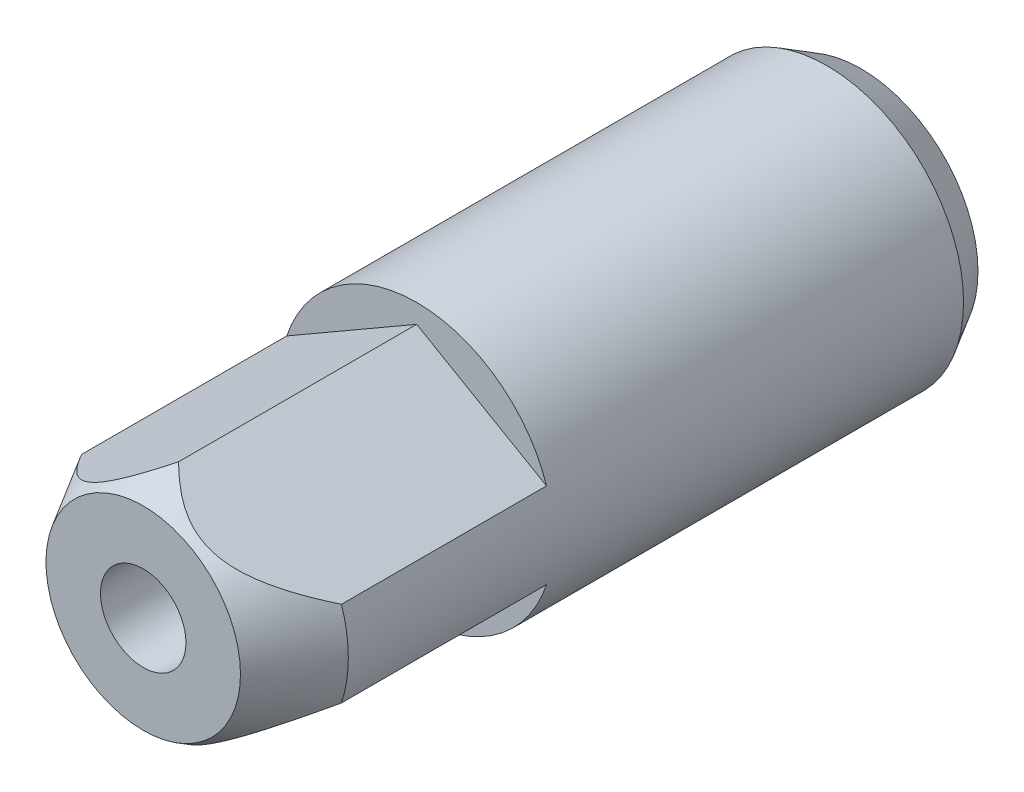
ISO-10303-21;
HEADER;
FILE_DESCRIPTION(('STEP AP214'),'2;1');
FILE_NAME('part.step','',(''),(''),'','','');
FILE_SCHEMA(('AUTOMOTIVE_DESIGN { 1 0 10303 214 1 1 1 1 }'));
ENDSEC;
DATA;
#1=APPLICATION_CONTEXT('core data for automotive mechanical design processes');
#2=APPLICATION_PROTOCOL_DEFINITION('international standard','automotive_design',2000,#1);
#3=PRODUCT_CONTEXT('',#1,'mechanical');
#4=PRODUCT('Part','Part','',(#3));
#5=PRODUCT_RELATED_PRODUCT_CATEGORY('part','',(#4));
#6=PRODUCT_DEFINITION_FORMATION('','',#4);
#7=PRODUCT_DEFINITION_CONTEXT('part definition',#1,'design');
#8=PRODUCT_DEFINITION('design','',#6,#7);
#9=PRODUCT_DEFINITION_SHAPE('','',#8);
#10=(LENGTH_UNIT() NAMED_UNIT(*) SI_UNIT(.MILLI.,.METRE.));
#11=(NAMED_UNIT(*) PLANE_ANGLE_UNIT() SI_UNIT($,.RADIAN.));
#12=(NAMED_UNIT(*) SI_UNIT($,.STERADIAN.) SOLID_ANGLE_UNIT());
#13=UNCERTAINTY_MEASURE_WITH_UNIT(LENGTH_MEASURE(1.E-05),#10,'distance_accuracy_value','');
#14=(GEOMETRIC_REPRESENTATION_CONTEXT(3) GLOBAL_UNCERTAINTY_ASSIGNED_CONTEXT((#13)) GLOBAL_UNIT_ASSIGNED_CONTEXT((#10,
#11,#12)) REPRESENTATION_CONTEXT('',''));
#15=CARTESIAN_POINT('',(0.,0.,0.));
#16=DIRECTION('',(0.,0.,1.));
#17=DIRECTION('',(1.,0.,0.));
#18=AXIS2_PLACEMENT_3D('',#15,#16,#17);
#19=CARTESIAN_POINT('',(0.,0.,38.));
#20=DIRECTION('',(0.,0.,-1.));
#21=DIRECTION('',(-1.,0.,0.));
#22=AXIS2_PLACEMENT_3D('',#19,#20,#21);
#23=CONICAL_SURFACE('',#22,8.,0.523598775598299);
#24=CARTESIAN_POINT('',(0.,0.,42.));
#25=DIRECTION('',(0.,0.,1.));
#26=DIRECTION('',(1.,0.,0.));
#27=AXIS2_PLACEMENT_3D('',#24,#25,#26);
#28=CIRCLE('',#27,5.69059892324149);
#29=CARTESIAN_POINT('',(5.69059892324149,0.,42.));
#30=VERTEX_POINT('',#29);
#31=EDGE_CURVE('E23',#30,#30,#28,.T.);
#32=ORIENTED_EDGE('',*,*,#31,.F.);
#33=EDGE_LOOP('',(#32));
#34=FACE_BOUND('',#33,.T.);
#35=CARTESIAN_POINT('',(-0.000200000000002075,6.88759766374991,39.926737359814));
#36=CARTESIAN_POINT('',(0.0621758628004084,6.85158494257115,39.9891099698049));
#37=CARTESIAN_POINT('',(0.125174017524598,6.81521294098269,40.0506508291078));
#38=CARTESIAN_POINT('',(0.25255184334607,6.74167131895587,40.171837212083));
#39=CARTESIAN_POINT('',(0.316931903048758,6.70450147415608,40.2314821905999));
#40=CARTESIAN_POINT('',(0.512959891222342,6.59132466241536,40.4077690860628));
#41=CARTESIAN_POINT('',(0.646862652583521,6.51401586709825,40.5211223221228));
#42=CARTESIAN_POINT('',(0.925137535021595,6.35335378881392,40.739049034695));
#43=CARTESIAN_POINT('',(1.06969195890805,6.26989525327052,40.8433150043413));
#44=CARTESIAN_POINT('',(1.3666329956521,6.0984562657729,41.0352268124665));
#45=CARTESIAN_POINT('',(1.51900131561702,6.01048637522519,41.1229094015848));
#46=CARTESIAN_POINT('',(1.76048177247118,5.8710675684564,41.2413705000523));
#47=CARTESIAN_POINT('',(1.84676611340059,5.82125128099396,41.2798680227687));
#48=CARTESIAN_POINT('',(2.02159456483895,5.72031402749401,41.3494007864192));
#49=CARTESIAN_POINT('',(2.11013884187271,5.66919296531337,41.3804354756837));
#50=CARTESIAN_POINT('',(2.28843143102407,5.56625569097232,41.4338564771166));
#51=CARTESIAN_POINT('',(2.37816468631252,5.51444817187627,41.4563092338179));
#52=CARTESIAN_POINT('',(2.55898090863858,5.41005387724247,41.4921001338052));
#53=CARTESIAN_POINT('',(2.65006360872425,5.35746725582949,41.5054400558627));
#54=CARTESIAN_POINT('',(2.83378402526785,5.25139622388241,41.5225546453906));
#55=CARTESIAN_POINT('',(2.92642828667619,5.19790803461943,41.5262368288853));
#56=CARTESIAN_POINT('',(3.11160774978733,5.09099462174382,41.5236094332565));
#57=CARTESIAN_POINT('',(3.20414295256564,5.03756939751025,41.5172999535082));
#58=CARTESIAN_POINT('',(3.38848330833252,4.93114044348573,41.49494073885));
#59=CARTESIAN_POINT('',(3.48028687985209,4.87813762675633,41.4788737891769));
#60=CARTESIAN_POINT('',(3.66233939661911,4.77302955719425,41.4376314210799));
#61=CARTESIAN_POINT('',(3.75258810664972,4.72092444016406,41.4124546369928));
#62=CARTESIAN_POINT('',(3.9565949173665,4.60314105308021,41.3454884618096));
#63=CARTESIAN_POINT('',(4.069689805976,4.53784568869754,41.3010068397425));
#64=CARTESIAN_POINT('',(4.29199124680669,4.4094998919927,41.2005329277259));
#65=CARTESIAN_POINT('',(4.40119535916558,4.34645086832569,41.144533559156));
#66=CARTESIAN_POINT('',(4.61649068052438,4.22215005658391,41.0225432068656));
#67=CARTESIAN_POINT('',(4.72254600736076,4.16091898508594,40.9564685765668));
#68=CARTESIAN_POINT('',(4.93065408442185,4.04076773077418,40.8165218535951));
#69=CARTESIAN_POINT('',(5.03270776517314,3.98184701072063,40.7426515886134));
#70=CARTESIAN_POINT('',(5.25319487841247,3.85454871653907,40.5731684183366));
#71=CARTESIAN_POINT('',(5.37082122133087,3.78663711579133,40.4761620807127));
#72=CARTESIAN_POINT('',(5.60141970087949,3.65350102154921,40.2750050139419));
#73=CARTESIAN_POINT('',(5.7143902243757,3.58827745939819,40.1708518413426));
#74=CARTESIAN_POINT('',(5.93650770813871,3.46003787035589,39.9566581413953));
#75=CARTESIAN_POINT('',(6.04564475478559,3.39702756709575,39.8466039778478));
#76=CARTESIAN_POINT('',(6.26036261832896,3.27306015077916,39.6219588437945));
#77=CARTESIAN_POINT('',(6.36594307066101,3.21210324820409,39.5073674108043));
#78=CARTESIAN_POINT('',(6.56914732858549,3.09478321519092,39.2799550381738));
#79=CARTESIAN_POINT('',(6.66691236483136,3.03833854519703,39.1673017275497));
#80=CARTESIAN_POINT('',(6.85998967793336,2.92686530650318,38.9392188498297));
#81=CARTESIAN_POINT('',(6.95530179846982,2.87183682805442,38.8237891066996));
#82=CARTESIAN_POINT('',(7.14317988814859,2.76336536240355,38.591342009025));
#83=CARTESIAN_POINT('',(7.23575931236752,2.70991460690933,38.4743391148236));
#84=CARTESIAN_POINT('',(7.41901297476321,2.6041130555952,38.2384048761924));
#85=CARTESIAN_POINT('',(7.50968762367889,2.55176202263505,38.1194739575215));
#86=CARTESIAN_POINT('',(7.59954207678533,2.49988452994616,37.999733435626));
#87=B_SPLINE_CURVE_WITH_KNOTS('',3,(#35,#36,#37,#38,#39,#40,#41,#42,#43,#44,#45,#46,#47,#48,#49,
#50,#51,#52,#53,#54,#55,#56,#57,#58,#59,#60,#61,#62,#63,#64,#65,#66,#67,#68,#69,#70,#71,#72,#73,
#74,#75,#76,#77,#78,#79,#80,#81,#82,#83,#84,#85,#86),.UNSPECIFIED.,.F.,.F.,(4,2,2,2,2,2,2,2,2,2,
2,2,2,2,2,2,2,2,2,2,2,2,2,2,2,4),(0.,0.285822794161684,0.571727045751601,1.14644748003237,
1.73621258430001,2.32465498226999,2.64484729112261,2.96506326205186,3.28274720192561,
3.60036911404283,3.92102170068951,4.24167109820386,4.56288785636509,4.88415278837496,
5.29735561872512,5.71081315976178,6.12791174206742,6.54491275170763,7.04532919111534,
7.54591758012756,8.0477172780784,8.54956825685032,9.02796034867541,9.50638285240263,
9.98181067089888,10.4571348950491),.UNSPECIFIED.);
#88=CARTESIAN_POINT('',(0.,6.88748219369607,39.9269373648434));
#89=VERTEX_POINT('',#88);
#90=CARTESIAN_POINT('',(7.59934207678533,2.5,38.));
#91=VERTEX_POINT('',#90);
#92=EDGE_CURVE('E102',#89,#91,#87,.T.);
#93=ORIENTED_EDGE('',*,*,#92,.F.);
#94=CARTESIAN_POINT('',(0.000200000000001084,6.88759766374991,39.926737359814));
#95=CARTESIAN_POINT('',(-0.0621758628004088,6.85158494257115,39.9891099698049));
#96=CARTESIAN_POINT('',(-0.125174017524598,6.81521294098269,40.0506508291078));
#97=CARTESIAN_POINT('',(-0.252551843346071,6.74167131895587,40.171837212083));
#98=CARTESIAN_POINT('',(-0.31693190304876,6.70450147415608,40.2314821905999));
#99=CARTESIAN_POINT('',(-0.512959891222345,6.59132466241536,40.4077690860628));
#100=CARTESIAN_POINT('',(-0.646862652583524,6.51401586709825,40.5211223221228));
#101=CARTESIAN_POINT('',(-0.925137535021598,6.35335378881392,40.739049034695));
#102=CARTESIAN_POINT('',(-1.06969195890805,6.26989525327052,40.8433150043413));
#103=CARTESIAN_POINT('',(-1.3666329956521,6.0984562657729,41.0352268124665));
#104=CARTESIAN_POINT('',(-1.51900131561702,6.01048637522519,41.1229094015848));
#105=CARTESIAN_POINT('',(-1.76048177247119,5.8710675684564,41.2413705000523));
#106=CARTESIAN_POINT('',(-1.84676611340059,5.82125128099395,41.2798680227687));
#107=CARTESIAN_POINT('',(-2.02159456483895,5.72031402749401,41.3494007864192));
#108=CARTESIAN_POINT('',(-2.11013884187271,5.66919296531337,41.3804354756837));
#109=CARTESIAN_POINT('',(-2.28843143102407,5.56625569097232,41.4338564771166));
#110=CARTESIAN_POINT('',(-2.37816468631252,5.51444817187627,41.4563092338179));
#111=CARTESIAN_POINT('',(-2.55898090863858,5.41005387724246,41.4921001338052));
#112=CARTESIAN_POINT('',(-2.65006360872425,5.35746725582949,41.5054400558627));
#113=CARTESIAN_POINT('',(-2.83378402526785,5.25139622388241,41.5225546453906));
#114=CARTESIAN_POINT('',(-2.92642828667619,5.19790803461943,41.5262368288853));
#115=CARTESIAN_POINT('',(-3.11160774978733,5.09099462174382,41.5236094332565));
#116=CARTESIAN_POINT('',(-3.20414295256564,5.03756939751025,41.5172999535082));
#117=CARTESIAN_POINT('',(-3.38848330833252,4.93114044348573,41.49494073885));
#118=CARTESIAN_POINT('',(-3.48028687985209,4.87813762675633,41.4788737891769));
#119=CARTESIAN_POINT('',(-3.66233939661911,4.77302955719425,41.4376314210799));
#120=CARTESIAN_POINT('',(-3.75258810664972,4.72092444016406,41.4124546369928));
#121=CARTESIAN_POINT('',(-3.9565949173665,4.60314105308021,41.3454884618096));
#122=CARTESIAN_POINT('',(-4.069689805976,4.53784568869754,41.3010068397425));
#123=CARTESIAN_POINT('',(-4.29199124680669,4.4094998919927,41.2005329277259));
#124=CARTESIAN_POINT('',(-4.40119535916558,4.34645086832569,41.144533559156));
#125=CARTESIAN_POINT('',(-4.61649068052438,4.22215005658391,41.0225432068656));
#126=CARTESIAN_POINT('',(-4.72254600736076,4.16091898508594,40.9564685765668));
#127=CARTESIAN_POINT('',(-4.93065408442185,4.04076773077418,40.8165218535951));
#128=CARTESIAN_POINT('',(-5.03270776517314,3.98184701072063,40.7426515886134));
#129=CARTESIAN_POINT('',(-5.25319487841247,3.85454871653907,40.5731684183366));
#130=CARTESIAN_POINT('',(-5.37082122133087,3.78663711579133,40.4761620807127));
#131=CARTESIAN_POINT('',(-5.60141970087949,3.65350102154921,40.2750050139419));
#132=CARTESIAN_POINT('',(-5.7143902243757,3.58827745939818,40.1708518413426));
#133=CARTESIAN_POINT('',(-5.93650770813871,3.46003787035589,39.9566581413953));
#134=CARTESIAN_POINT('',(-6.04564475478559,3.39702756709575,39.8466039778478));
#135=CARTESIAN_POINT('',(-6.26036261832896,3.27306015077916,39.6219588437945));
#136=CARTESIAN_POINT('',(-6.36594307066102,3.21210324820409,39.5073674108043));
#137=CARTESIAN_POINT('',(-6.5691473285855,3.09478321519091,39.2799550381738));
#138=CARTESIAN_POINT('',(-6.66691236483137,3.03833854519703,39.1673017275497));
#139=CARTESIAN_POINT('',(-6.85998967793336,2.92686530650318,38.9392188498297));
#140=CARTESIAN_POINT('',(-6.95530179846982,2.87183682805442,38.8237891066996));
#141=CARTESIAN_POINT('',(-7.14317988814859,2.76336536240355,38.5913420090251));
#142=CARTESIAN_POINT('',(-7.23575931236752,2.70991460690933,38.4743391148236));
#143=CARTESIAN_POINT('',(-7.4190129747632,2.6041130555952,38.2384048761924));
#144=CARTESIAN_POINT('',(-7.50968762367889,2.55176202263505,38.1194739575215));
#145=CARTESIAN_POINT('',(-7.59954207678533,2.49988452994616,37.999733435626));
#146=B_SPLINE_CURVE_WITH_KNOTS('',3,(#94,#95,#96,#97,#98,#99,#100,#101,#102,#103,#104,#105,#106,
#107,#108,#109,#110,#111,#112,#113,#114,#115,#116,#117,#118,#119,#120,#121,#122,#123,#124,#125,
#126,#127,#128,#129,#130,#131,#132,#133,#134,#135,#136,#137,#138,#139,#140,#141,#142,#143,#144,
#145),.UNSPECIFIED.,.F.,.F.,(4,2,2,2,2,2,2,2,2,2,2,2,2,2,2,2,2,2,2,2,2,2,2,2,2,4),(0.,
0.285822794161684,0.571727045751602,1.14644748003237,1.73621258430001,2.32465498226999,
2.64484729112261,2.96506326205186,3.28274720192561,3.60036911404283,3.92102170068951,
4.24167109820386,4.56288785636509,4.88415278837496,5.29735561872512,5.71081315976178,
6.12791174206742,6.54491275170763,7.04532919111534,7.54591758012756,8.04771727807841,
8.54956825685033,9.02796034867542,9.50638285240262,9.98181067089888,10.4571348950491),.UNSPECIFIED.);
#147=CARTESIAN_POINT('',(-7.59934207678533,2.5,38.));
#148=VERTEX_POINT('',#147);
#149=EDGE_CURVE('E75',#89,#148,#146,.T.);
#150=ORIENTED_EDGE('',*,*,#149,.T.);
#151=CARTESIAN_POINT('',(0.,0.,38.));
#152=DIRECTION('',(0.,0.,1.));
#153=DIRECTION('',(1.,0.,0.));
#154=AXIS2_PLACEMENT_3D('',#151,#152,#153);
#155=CIRCLE('',#154,8.);
#156=CARTESIAN_POINT('',(-7.59934207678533,-2.5,38.));
#157=VERTEX_POINT('',#156);
#158=EDGE_CURVE('E155',#148,#157,#155,.T.);
#159=ORIENTED_EDGE('',*,*,#158,.T.);
#160=CARTESIAN_POINT('',(0.000199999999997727,-6.88759766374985,39.9267373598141));
#161=CARTESIAN_POINT('',(-0.0621758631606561,-6.85158494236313,39.9891099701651));
#162=CARTESIAN_POINT('',(-0.125174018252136,-6.81521294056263,40.0506508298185));
#163=CARTESIAN_POINT('',(-0.252551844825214,-6.74167131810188,40.1718372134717));
#164=CARTESIAN_POINT('',(-0.316931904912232,-6.70450147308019,40.2314821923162));
#165=CARTESIAN_POINT('',(-0.512959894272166,-6.59132466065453,40.407769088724));
#166=CARTESIAN_POINT('',(-0.646862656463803,-6.51401586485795,40.5211223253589));
#167=CARTESIAN_POINT('',(-0.925137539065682,-6.35335378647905,40.7390490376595));
#168=CARTESIAN_POINT('',(-1.06969196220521,-6.26989525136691,40.8433150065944));
#169=CARTESIAN_POINT('',(-1.36663299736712,-6.09845626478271,41.0352268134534));
#170=CARTESIAN_POINT('',(-1.51900131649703,-6.01048637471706,41.1229094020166));
#171=CARTESIAN_POINT('',(-1.76048177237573,-5.87106756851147,41.2413705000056));
#172=CARTESIAN_POINT('',(-1.84676611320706,-5.82125128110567,41.2798680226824));
#173=CARTESIAN_POINT('',(-2.02159456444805,-5.72031402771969,41.3494007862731));
#174=CARTESIAN_POINT('',(-2.11013884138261,-5.66919296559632,41.3804354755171));
#175=CARTESIAN_POINT('',(-2.28843143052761,-5.56625569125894,41.4338564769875));
#176=CARTESIAN_POINT('',(-2.37816468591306,-5.51444817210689,41.4563092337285));
#177=CARTESIAN_POINT('',(-2.55898090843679,-5.41005387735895,41.4921001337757));
#178=CARTESIAN_POINT('',(-2.65006360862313,-5.35746725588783,41.5054400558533));
#179=CARTESIAN_POINT('',(-2.8337840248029,-5.25139622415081,41.5225546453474));
#180=CARTESIAN_POINT('',(-2.92642828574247,-5.1979080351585,41.5262368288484));
#181=CARTESIAN_POINT('',(-3.111607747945,-5.09099462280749,41.5236094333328));
#182=CARTESIAN_POINT('',(-3.20414295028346,-5.03756939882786,41.517299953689));
#183=CARTESIAN_POINT('',(-3.38848330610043,-4.93114044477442,41.494940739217));
#184=CARTESIAN_POINT('',(-3.48028687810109,-4.87813762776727,41.4788737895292));
#185=CARTESIAN_POINT('',(-3.66233939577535,-4.77302955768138,41.4376314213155));
#186=CARTESIAN_POINT('',(-3.75258810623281,-4.72092444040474,41.4124546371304));
#187=CARTESIAN_POINT('',(-3.95659492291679,-4.60314104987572,41.3454884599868));
#188=CARTESIAN_POINT('',(-4.06968981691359,-4.53784568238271,41.3010068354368));
#189=CARTESIAN_POINT('',(-4.2919912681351,-4.40949987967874,41.200532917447));
#190=CARTESIAN_POINT('',(-4.40119538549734,-4.34645085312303,41.1445335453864));
#191=CARTESIAN_POINT('',(-4.61649070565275,-4.22215004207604,41.0225431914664));
#192=CARTESIAN_POINT('',(-4.72254602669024,-4.16091897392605,40.9564685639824));
#193=CARTESIAN_POINT('',(-4.93065409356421,-4.04076772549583,40.8165218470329));
#194=CARTESIAN_POINT('',(-5.03270776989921,-3.98184700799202,40.7426515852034));
#195=CARTESIAN_POINT('',(-5.25319208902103,-3.85455032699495,40.5731705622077));
#196=CARTESIAN_POINT('',(-5.37081576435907,-3.78664026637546,40.4761665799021));
#197=CARTESIAN_POINT('',(-5.60140910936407,-3.65350713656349,40.2750145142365));
#198=CARTESIAN_POINT('',(-5.71437716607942,-3.58828499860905,40.1708639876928));
#199=CARTESIAN_POINT('',(-5.93648986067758,-3.46004817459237,39.956675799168));
#200=CARTESIAN_POINT('',(-6.04562458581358,-3.39703921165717,39.8466245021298));
#201=CARTESIAN_POINT('',(-6.26033793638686,-3.27307440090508,39.6219852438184));
#202=CARTESIAN_POINT('',(-6.36591619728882,-3.21211876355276,39.5073968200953));
#203=CARTESIAN_POINT('',(-6.56911642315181,-3.09480105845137,39.279990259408));
#204=CARTESIAN_POINT('',(-6.66687960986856,-3.03835745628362,39.1673397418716));
#205=CARTESIAN_POINT('',(-6.85995329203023,-2.92688631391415,38.939262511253));
#206=CARTESIAN_POINT('',(-6.95526363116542,-2.87185886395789,38.8238356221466));
#207=CARTESIAN_POINT('',(-7.14313824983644,-2.76338940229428,38.591394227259));
#208=CARTESIAN_POINT('',(-7.23571598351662,-2.70993962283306,38.4743941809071));
#209=CARTESIAN_POINT('',(-7.41896630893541,-2.60413999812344,38.2384656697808));
#210=CARTESIAN_POINT('',(-7.509639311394,-2.55178991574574,38.1195376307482));
#211=CARTESIAN_POINT('',(-7.59949213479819,-2.49991336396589,37.9998));
#212=B_SPLINE_CURVE_WITH_KNOTS('',3,(#160,#161,#162,#163,#164,#165,#166,#167,#168,#169,#170,
#171,#172,#173,#174,#175,#176,#177,#178,#179,#180,#181,#182,#183,#184,#185,#186,#187,#188,#189,
#190,#191,#192,#193,#194,#195,#196,#197,#198,#199,#200,#201,#202,#203,#204,#205,#206,#207,#208,
#209,#210,#211),.UNSPECIFIED.,.F.,.F.,(4,2,2,2,2,2,2,2,2,2,2,2,2,2,2,2,2,2,2,2,2,2,2,2,2,4),(0.,
0.285822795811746,0.571727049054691,1.14644748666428,1.73621258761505,2.32465498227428,
2.64484729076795,2.96506326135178,3.28274720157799,3.60036911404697,3.92102169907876,
4.24167109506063,4.56288785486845,4.88415278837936,5.2973556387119,5.71081319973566,
6.12791176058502,6.54491275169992,7.04531758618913,7.54589435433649,8.04768234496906,
8.54952161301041,9.02790325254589,9.50631530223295,9.98173286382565,10.4570468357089),.UNSPECIFIED.);
#213=CARTESIAN_POINT('',(0.,-6.88748219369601,39.9269373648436));
#214=VERTEX_POINT('',#213);
#215=EDGE_CURVE('E129',#214,#157,#212,.T.);
#216=ORIENTED_EDGE('',*,*,#215,.F.);
#217=CARTESIAN_POINT('',(-0.000200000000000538,-6.88759766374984,39.9267373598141));
#218=CARTESIAN_POINT('',(0.0621758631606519,-6.85158494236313,39.9891099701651));
#219=CARTESIAN_POINT('',(0.125174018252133,-6.81521294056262,40.0506508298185));
#220=CARTESIAN_POINT('',(0.252551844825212,-6.74167131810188,40.1718372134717));
#221=CARTESIAN_POINT('',(0.31693190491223,-6.70450147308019,40.2314821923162));
#222=CARTESIAN_POINT('',(0.512959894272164,-6.59132466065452,40.407769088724));
#223=CARTESIAN_POINT('',(0.646862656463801,-6.51401586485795,40.5211223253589));
#224=CARTESIAN_POINT('',(0.925137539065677,-6.35335378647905,40.7390490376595));
#225=CARTESIAN_POINT('',(1.0696919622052,-6.26989525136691,40.8433150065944));
#226=CARTESIAN_POINT('',(1.36663299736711,-6.09845626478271,41.0352268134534));
#227=CARTESIAN_POINT('',(1.51900131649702,-6.01048637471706,41.1229094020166));
#228=CARTESIAN_POINT('',(1.76048177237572,-5.87106756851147,41.2413705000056));
#229=CARTESIAN_POINT('',(1.84676611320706,-5.82125128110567,41.2798680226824));
#230=CARTESIAN_POINT('',(2.02159456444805,-5.72031402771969,41.3494007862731));
#231=CARTESIAN_POINT('',(2.1101388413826,-5.66919296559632,41.3804354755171));
#232=CARTESIAN_POINT('',(2.28843143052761,-5.56625569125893,41.4338564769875));
#233=CARTESIAN_POINT('',(2.37816468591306,-5.51444817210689,41.4563092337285));
#234=CARTESIAN_POINT('',(2.55898090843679,-5.41005387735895,41.4921001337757));
#235=CARTESIAN_POINT('',(2.65006360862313,-5.35746725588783,41.5054400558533));
#236=CARTESIAN_POINT('',(2.8337840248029,-5.25139622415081,41.5225546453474));
#237=CARTESIAN_POINT('',(2.92642828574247,-5.1979080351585,41.5262368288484));
#238=CARTESIAN_POINT('',(3.111607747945,-5.09099462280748,41.5236094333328));
#239=CARTESIAN_POINT('',(3.20414295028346,-5.03756939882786,41.517299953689));
#240=CARTESIAN_POINT('',(3.38848330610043,-4.93114044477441,41.494940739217));
#241=CARTESIAN_POINT('',(3.48028687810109,-4.87813762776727,41.4788737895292));
#242=CARTESIAN_POINT('',(3.66233939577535,-4.77302955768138,41.4376314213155));
#243=CARTESIAN_POINT('',(3.75258810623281,-4.72092444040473,41.4124546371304));
#244=CARTESIAN_POINT('',(3.95659492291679,-4.60314104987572,41.3454884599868));
#245=CARTESIAN_POINT('',(4.06968981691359,-4.53784568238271,41.3010068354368));
#246=CARTESIAN_POINT('',(4.2919912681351,-4.40949987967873,41.200532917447));
#247=CARTESIAN_POINT('',(4.40119538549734,-4.34645085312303,41.1445335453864));
#248=CARTESIAN_POINT('',(4.61649070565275,-4.22215004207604,41.0225431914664));
#249=CARTESIAN_POINT('',(4.72254602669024,-4.16091897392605,40.9564685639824));
#250=CARTESIAN_POINT('',(4.9306540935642,-4.04076772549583,40.8165218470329));
#251=CARTESIAN_POINT('',(5.0327077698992,-3.98184700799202,40.7426515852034));
#252=CARTESIAN_POINT('',(5.25319208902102,-3.85455032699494,40.5731705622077));
#253=CARTESIAN_POINT('',(5.37081576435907,-3.78664026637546,40.4761665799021));
#254=CARTESIAN_POINT('',(5.60140910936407,-3.65350713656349,40.2750145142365));
#255=CARTESIAN_POINT('',(5.71437716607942,-3.58828499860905,40.1708639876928));
#256=CARTESIAN_POINT('',(5.93648986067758,-3.46004817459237,39.956675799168));
#257=CARTESIAN_POINT('',(6.04562458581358,-3.39703921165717,39.8466245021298));
#258=CARTESIAN_POINT('',(6.26033793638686,-3.27307440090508,39.6219852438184));
#259=CARTESIAN_POINT('',(6.36591619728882,-3.21211876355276,39.5073968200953));
#260=CARTESIAN_POINT('',(6.56911642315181,-3.09480105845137,39.279990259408));
#261=CARTESIAN_POINT('',(6.66687960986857,-3.03835745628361,39.1673397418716));
#262=CARTESIAN_POINT('',(6.85995329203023,-2.92688631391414,38.939262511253));
#263=CARTESIAN_POINT('',(6.95526363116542,-2.87185886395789,38.8238356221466));
#264=CARTESIAN_POINT('',(7.14313824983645,-2.76338940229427,38.591394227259));
#265=CARTESIAN_POINT('',(7.23571598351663,-2.70993962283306,38.4743941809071));
#266=CARTESIAN_POINT('',(7.41896630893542,-2.60413999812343,38.2384656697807));
#267=CARTESIAN_POINT('',(7.509639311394,-2.55178991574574,38.1195376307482));
#268=CARTESIAN_POINT('',(7.59949213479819,-2.49991336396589,37.9998));
#269=B_SPLINE_CURVE_WITH_KNOTS('',3,(#217,#218,#219,#220,#221,#222,#223,#224,#225,#226,#227,
#228,#229,#230,#231,#232,#233,#234,#235,#236,#237,#238,#239,#240,#241,#242,#243,#244,#245,#246,
#247,#248,#249,#250,#251,#252,#253,#254,#255,#256,#257,#258,#259,#260,#261,#262,#263,#264,#265,
#266,#267,#268),.UNSPECIFIED.,.F.,.F.,(4,2,2,2,2,2,2,2,2,2,2,2,2,2,2,2,2,2,2,2,2,2,2,2,2,4),(0.,
0.285822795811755,0.571727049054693,1.14644748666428,1.73621258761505,2.32465498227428,
2.64484729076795,2.96506326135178,3.28274720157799,3.60036911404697,3.92102169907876,
4.24167109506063,4.56288785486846,4.88415278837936,5.2973556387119,5.71081319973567,
6.12791176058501,6.54491275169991,7.04531758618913,7.54589435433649,8.04768234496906,
8.54952161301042,9.02790325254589,9.50631530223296,9.98173286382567,10.4570468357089),.UNSPECIFIED.);
#270=CARTESIAN_POINT('',(7.59934207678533,-2.5,38.));
#271=VERTEX_POINT('',#270);
#272=EDGE_CURVE('E138',#214,#271,#269,.T.);
#273=ORIENTED_EDGE('',*,*,#272,.T.);
#274=EDGE_CURVE('E156',#271,#91,#155,.T.);
#275=ORIENTED_EDGE('',*,*,#274,.T.);
#276=EDGE_LOOP('',(#93,#150,#159,#216,#273,#275));
#277=FACE_BOUND('',#276,.T.);
#278=ADVANCED_FACE('F15',(#34,#277),#23,.T.);
#279=CARTESIAN_POINT('',(0.,0.,30.));
#280=DIRECTION('',(0.,0.,1.));
#281=DIRECTION('',(1.,0.,0.));
#282=AXIS2_PLACEMENT_3D('',#279,#280,#281);
#283=CYLINDRICAL_SURFACE('',#282,8.);
#284=CARTESIAN_POINT('',(0.,0.,2.));
#285=DIRECTION('',(0.,0.,1.));
#286=DIRECTION('',(1.,0.,0.));
#287=AXIS2_PLACEMENT_3D('',#284,#285,#286);
#288=CIRCLE('',#287,8.);
#289=CARTESIAN_POINT('',(8.,0.,2.));
#290=VERTEX_POINT('',#289);
#291=EDGE_CURVE('E152',#290,#290,#288,.T.);
#292=ORIENTED_EDGE('',*,*,#291,.T.);
#293=EDGE_LOOP('',(#292));
#294=FACE_BOUND('',#293,.T.);
#295=DIRECTION('',(0.,0.,1.));
#296=VECTOR('',#295,1.);
#297=CARTESIAN_POINT('',(7.59934207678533,2.5,26.));
#298=LINE('',#297,#296);
#299=CARTESIAN_POINT('',(7.59934207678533,2.5,26.));
#300=VERTEX_POINT('',#299);
#301=EDGE_CURVE('E82',#300,#91,#298,.T.);
#302=ORIENTED_EDGE('',*,*,#301,.T.);
#303=ORIENTED_EDGE('',*,*,#274,.F.);
#304=DIRECTION('',(0.,0.,1.));
#305=VECTOR('',#304,1.);
#306=CARTESIAN_POINT('',(7.59934207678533,-2.5,26.));
#307=LINE('',#306,#305);
#308=CARTESIAN_POINT('',(7.59934207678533,-2.5,26.));
#309=VERTEX_POINT('',#308);
#310=EDGE_CURVE('E179',#309,#271,#307,.T.);
#311=ORIENTED_EDGE('',*,*,#310,.F.);
#312=CARTESIAN_POINT('',(0.,0.,26.));
#313=DIRECTION('',(0.,0.,1.));
#314=DIRECTION('',(1.,0.,0.));
#315=AXIS2_PLACEMENT_3D('',#312,#313,#314);
#316=CIRCLE('',#315,8.);
#317=CARTESIAN_POINT('',(-7.59934207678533,-2.5,26.));
#318=VERTEX_POINT('',#317);
#319=EDGE_CURVE('E169',#318,#309,#316,.T.);
#320=ORIENTED_EDGE('',*,*,#319,.F.);
#321=DIRECTION('',(0.,0.,1.));
#322=VECTOR('',#321,1.);
#323=CARTESIAN_POINT('',(-7.59934207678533,-2.5,26.));
#324=LINE('',#323,#322);
#325=EDGE_CURVE('E176',#318,#157,#324,.T.);
#326=ORIENTED_EDGE('',*,*,#325,.T.);
#327=ORIENTED_EDGE('',*,*,#158,.F.);
#328=DIRECTION('',(0.,0.,1.));
#329=VECTOR('',#328,1.);
#330=CARTESIAN_POINT('',(-7.59934207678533,2.5,26.));
#331=LINE('',#330,#329);
#332=CARTESIAN_POINT('',(-7.59934207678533,2.5,26.));
#333=VERTEX_POINT('',#332);
#334=EDGE_CURVE('E78',#333,#148,#331,.T.);
#335=ORIENTED_EDGE('',*,*,#334,.F.);
#336=CARTESIAN_POINT('',(0.,0.,26.));
#337=DIRECTION('',(0.,0.,1.));
#338=DIRECTION('',(1.,0.,0.));
#339=AXIS2_PLACEMENT_3D('',#336,#337,#338);
#340=CIRCLE('',#339,8.);
#341=EDGE_CURVE('E86',#300,#333,#340,.T.);
#342=ORIENTED_EDGE('',*,*,#341,.F.);
#343=EDGE_LOOP('',(#302,#303,#311,#320,#326,#327,#335,#342));
#344=FACE_BOUND('',#343,.T.);
#345=ADVANCED_FACE('F165',(#294,#344),#283,.T.);
#346=CARTESIAN_POINT('',(0.,0.,30.));
#347=DIRECTION('',(0.,0.,1.));
#348=DIRECTION('',(1.,0.,0.));
#349=AXIS2_PLACEMENT_3D('',#346,#347,#348);
#350=CYLINDRICAL_SURFACE('',#349,2.5);
#351=CARTESIAN_POINT('',(0.,0.,32.));
#352=DIRECTION('',(0.,0.,1.));
#353=DIRECTION('',(1.,0.,0.));
#354=AXIS2_PLACEMENT_3D('',#351,#352,#353);
#355=CIRCLE('',#354,2.5);
#356=CARTESIAN_POINT('',(2.5,0.,32.));
#357=VERTEX_POINT('',#356);
#358=EDGE_CURVE('E89',#357,#357,#355,.T.);
#359=ORIENTED_EDGE('',*,*,#358,.F.);
#360=EDGE_LOOP('',(#359));
#361=FACE_BOUND('',#360,.T.);
#362=CARTESIAN_POINT('',(0.,0.,42.));
#363=DIRECTION('',(0.,0.,1.));
#364=DIRECTION('',(1.,0.,0.));
#365=AXIS2_PLACEMENT_3D('',#362,#363,#364);
#366=CIRCLE('',#365,2.5);
#367=CARTESIAN_POINT('',(2.5,0.,42.));
#368=VERTEX_POINT('',#367);
#369=EDGE_CURVE('E9',#368,#368,#366,.T.);
#370=ORIENTED_EDGE('',*,*,#369,.T.);
#371=EDGE_LOOP('',(#370));
#372=FACE_BOUND('',#371,.T.);
#373=ADVANCED_FACE('F17',(#361,#372),#350,.F.);
#374=CARTESIAN_POINT('',(5.69059892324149,0.,42.));
#375=DIRECTION('',(0.,0.,-1.));
#376=DIRECTION('',(-1.,0.,0.));
#377=AXIS2_PLACEMENT_3D('',#374,#375,#376);
#378=PLANE('',#377);
#379=ORIENTED_EDGE('',*,*,#369,.F.);
#380=EDGE_LOOP('',(#379));
#381=FACE_BOUND('',#380,.T.);
#382=ORIENTED_EDGE('',*,*,#31,.T.);
#383=EDGE_LOOP('',(#382));
#384=FACE_BOUND('',#383,.T.);
#385=ADVANCED_FACE('F161',(#381,#384),#378,.F.);
#386=CARTESIAN_POINT('',(0.,0.,0.));
#387=DIRECTION('',(0.,0.,1.));
#388=DIRECTION('',(1.,0.,0.));
#389=AXIS2_PLACEMENT_3D('',#386,#387,#388);
#390=CONICAL_SURFACE('',#389,6.84529946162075,0.523598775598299);
#391=ORIENTED_EDGE('',*,*,#291,.F.);
#392=EDGE_LOOP('',(#391));
#393=FACE_BOUND('',#392,.T.);
#394=CARTESIAN_POINT('',(0.,0.,0.));
#395=DIRECTION('',(0.,0.,1.));
#396=DIRECTION('',(1.,0.,0.));
#397=AXIS2_PLACEMENT_3D('',#394,#395,#396);
#398=CIRCLE('',#397,6.84529946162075);
#399=CARTESIAN_POINT('',(6.84529946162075,0.,0.));
#400=VERTEX_POINT('',#399);
#401=EDGE_CURVE('E149',#400,#400,#398,.T.);
#402=ORIENTED_EDGE('',*,*,#401,.T.);
#403=EDGE_LOOP('',(#402));
#404=FACE_BOUND('',#403,.T.);
#405=ADVANCED_FACE('F252',(#393,#404),#390,.T.);
#406=CARTESIAN_POINT('',(1.,0.,0.));
#407=DIRECTION('',(0.,0.,1.));
#408=DIRECTION('',(1.,0.,0.));
#409=AXIS2_PLACEMENT_3D('',#406,#407,#408);
#410=PLANE('',#409);
#411=ORIENTED_EDGE('',*,*,#401,.F.);
#412=EDGE_LOOP('',(#411));
#413=FACE_BOUND('',#412,.T.);
#414=CARTESIAN_POINT('',(0.,0.,0.));
#415=DIRECTION('',(0.,0.,1.));
#416=DIRECTION('',(1.,0.,0.));
#417=AXIS2_PLACEMENT_3D('',#414,#415,#416);
#418=CIRCLE('',#417,1.);
#419=CARTESIAN_POINT('',(1.,0.,0.));
#420=VERTEX_POINT('',#419);
#421=EDGE_CURVE('E146',#420,#420,#418,.T.);
#422=ORIENTED_EDGE('',*,*,#421,.T.);
#423=EDGE_LOOP('',(#422));
#424=FACE_BOUND('',#423,.T.);
#425=ADVANCED_FACE('F257',(#413,#424),#410,.F.);
#426=CARTESIAN_POINT('',(0.,0.,30.));
#427=DIRECTION('',(0.,0.,1.));
#428=DIRECTION('',(1.,0.,0.));
#429=AXIS2_PLACEMENT_3D('',#426,#427,#428);
#430=CYLINDRICAL_SURFACE('',#429,1.);
#431=ORIENTED_EDGE('',*,*,#421,.F.);
#432=EDGE_LOOP('',(#431));
#433=FACE_BOUND('',#432,.T.);
#434=CARTESIAN_POINT('',(0.,0.,4.));
#435=DIRECTION('',(0.,0.,1.));
#436=DIRECTION('',(1.,0.,0.));
#437=AXIS2_PLACEMENT_3D('',#434,#435,#436);
#438=CIRCLE('',#437,1.);
#439=CARTESIAN_POINT('',(1.,0.,4.));
#440=VERTEX_POINT('',#439);
#441=EDGE_CURVE('E137',#440,#440,#438,.T.);
#442=ORIENTED_EDGE('',*,*,#441,.T.);
#443=EDGE_LOOP('',(#442));
#444=FACE_BOUND('',#443,.T.);
#445=ADVANCED_FACE('F266',(#433,#444),#430,.F.);
#446=CARTESIAN_POINT('',(0.,0.,4.));
#447=DIRECTION('',(0.,0.,1.));
#448=DIRECTION('',(1.,0.,0.));
#449=AXIS2_PLACEMENT_3D('',#446,#447,#448);
#450=PLANE('',#449);
#451=ORIENTED_EDGE('',*,*,#441,.F.);
#452=EDGE_LOOP('',(#451));
#453=FACE_BOUND('',#452,.T.);
#454=ADVANCED_FACE('F124',(#453),#450,.F.);
#455=CARTESIAN_POINT('',(-7.59934207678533,-2.5,26.));
#456=DIRECTION('',(-0.5,-0.866025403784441,0.));
#457=DIRECTION('',(0.866025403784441,-0.5,0.));
#458=AXIS2_PLACEMENT_3D('',#455,#456,#457);
#459=PLANE('',#458);
#460=ORIENTED_EDGE('',*,*,#215,.T.);
#461=ORIENTED_EDGE('',*,*,#325,.F.);
#462=DIRECTION('',(0.866025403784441,-0.5,0.));
#463=VECTOR('',#462,1.);
#464=CARTESIAN_POINT('',(-7.59934207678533,-2.5,26.));
#465=LINE('',#464,#463);
#466=CARTESIAN_POINT('',(0.,-6.88748219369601,26.));
#467=VERTEX_POINT('',#466);
#468=EDGE_CURVE('E38',#318,#467,#465,.T.);
#469=ORIENTED_EDGE('',*,*,#468,.T.);
#470=DIRECTION('',(0.,0.,1.));
#471=VECTOR('',#470,1.);
#472=CARTESIAN_POINT('',(0.,-6.88748219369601,26.));
#473=LINE('',#472,#471);
#474=EDGE_CURVE('E180',#467,#214,#473,.T.);
#475=ORIENTED_EDGE('',*,*,#474,.T.);
#476=EDGE_LOOP('',(#460,#461,#469,#475));
#477=FACE_BOUND('',#476,.T.);
#478=ADVANCED_FACE('F120',(#477),#459,.T.);
#479=CARTESIAN_POINT('',(7.59934207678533,-2.5,26.));
#480=DIRECTION('',(-0.5,0.866025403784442,0.));
#481=DIRECTION('',(-0.866025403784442,-0.5,0.));
#482=AXIS2_PLACEMENT_3D('',#479,#480,#481);
#483=PLANE('',#482);
#484=ORIENTED_EDGE('',*,*,#474,.F.);
#485=DIRECTION('',(-0.866025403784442,-0.5,0.));
#486=VECTOR('',#485,1.);
#487=CARTESIAN_POINT('',(7.59934207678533,-2.5,26.));
#488=LINE('',#487,#486);
#489=EDGE_CURVE('E170',#309,#467,#488,.T.);
#490=ORIENTED_EDGE('',*,*,#489,.F.);
#491=ORIENTED_EDGE('',*,*,#310,.T.);
#492=ORIENTED_EDGE('',*,*,#272,.F.);
#493=EDGE_LOOP('',(#484,#490,#491,#492));
#494=FACE_BOUND('',#493,.T.);
#495=ADVANCED_FACE('F119',(#494),#483,.F.);
#496=CARTESIAN_POINT('',(0.,0.,26.));
#497=DIRECTION('',(0.,0.,1.));
#498=DIRECTION('',(1.,0.,0.));
#499=AXIS2_PLACEMENT_3D('',#496,#497,#498);
#500=PLANE('',#499);
#501=ORIENTED_EDGE('',*,*,#468,.F.);
#502=ORIENTED_EDGE('',*,*,#319,.T.);
#503=ORIENTED_EDGE('',*,*,#489,.T.);
#504=EDGE_LOOP('',(#501,#502,#503));
#505=FACE_BOUND('',#504,.T.);
#506=ADVANCED_FACE('F116',(#505),#500,.T.);
#507=CARTESIAN_POINT('',(7.59934207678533,2.5,26.));
#508=DIRECTION('',(0.5,0.866025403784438,0.));
#509=DIRECTION('',(-0.866025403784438,0.5,0.));
#510=AXIS2_PLACEMENT_3D('',#507,#508,#509);
#511=PLANE('',#510);
#512=ORIENTED_EDGE('',*,*,#92,.T.);
#513=ORIENTED_EDGE('',*,*,#301,.F.);
#514=DIRECTION('',(-0.866025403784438,0.5,0.));
#515=VECTOR('',#514,1.);
#516=CARTESIAN_POINT('',(7.59934207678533,2.5,26.));
#517=LINE('',#516,#515);
#518=CARTESIAN_POINT('',(0.,6.88748219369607,26.));
#519=VERTEX_POINT('',#518);
#520=EDGE_CURVE('E30',#300,#519,#517,.T.);
#521=ORIENTED_EDGE('',*,*,#520,.T.);
#522=DIRECTION('',(0.,0.,1.));
#523=VECTOR('',#522,1.);
#524=CARTESIAN_POINT('',(0.,6.88748219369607,26.));
#525=LINE('',#524,#523);
#526=EDGE_CURVE('E71',#519,#89,#525,.T.);
#527=ORIENTED_EDGE('',*,*,#526,.T.);
#528=EDGE_LOOP('',(#512,#513,#521,#527));
#529=FACE_BOUND('',#528,.T.);
#530=ADVANCED_FACE('F80',(#529),#511,.T.);
#531=CARTESIAN_POINT('',(-7.59934207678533,2.5,26.));
#532=DIRECTION('',(0.5,-0.866025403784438,0.));
#533=DIRECTION('',(0.866025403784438,0.5,0.));
#534=AXIS2_PLACEMENT_3D('',#531,#532,#533);
#535=PLANE('',#534);
#536=ORIENTED_EDGE('',*,*,#526,.F.);
#537=DIRECTION('',(0.866025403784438,0.5,0.));
#538=VECTOR('',#537,1.);
#539=CARTESIAN_POINT('',(-7.59934207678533,2.5,26.));
#540=LINE('',#539,#538);
#541=EDGE_CURVE('E73',#333,#519,#540,.T.);
#542=ORIENTED_EDGE('',*,*,#541,.F.);
#543=ORIENTED_EDGE('',*,*,#334,.T.);
#544=ORIENTED_EDGE('',*,*,#149,.F.);
#545=EDGE_LOOP('',(#536,#542,#543,#544));
#546=FACE_BOUND('',#545,.T.);
#547=ADVANCED_FACE('F72',(#546),#535,.F.);
#548=CARTESIAN_POINT('',(0.,0.,26.));
#549=DIRECTION('',(0.,0.,1.));
#550=DIRECTION('',(1.,0.,0.));
#551=AXIS2_PLACEMENT_3D('',#548,#549,#550);
#552=PLANE('',#551);
#553=ORIENTED_EDGE('',*,*,#520,.F.);
#554=ORIENTED_EDGE('',*,*,#341,.T.);
#555=ORIENTED_EDGE('',*,*,#541,.T.);
#556=EDGE_LOOP('',(#553,#554,#555));
#557=FACE_BOUND('',#556,.T.);
#558=ADVANCED_FACE('F85',(#557),#552,.T.);
#559=CARTESIAN_POINT('',(0.,0.,32.));
#560=DIRECTION('',(0.,0.,1.));
#561=DIRECTION('',(1.,0.,0.));
#562=AXIS2_PLACEMENT_3D('',#559,#560,#561);
#563=PLANE('',#562);
#564=ORIENTED_EDGE('',*,*,#358,.T.);
#565=EDGE_LOOP('',(#564));
#566=FACE_BOUND('',#565,.T.);
#567=ADVANCED_FACE('F217',(#566),#563,.T.);
#568=CLOSED_SHELL('',(#278,#345,#373,#385,#405,#425,#445,#454,#478,#495,#506,#530,#547,#558,#567));
#569=MANIFOLD_SOLID_BREP('B1',#568);
#570=ADVANCED_BREP_SHAPE_REPRESENTATION('',(#18,#569),#14);
#571=SHAPE_DEFINITION_REPRESENTATION(#9,#570);
ENDSEC;
END-ISO-10303-21;
